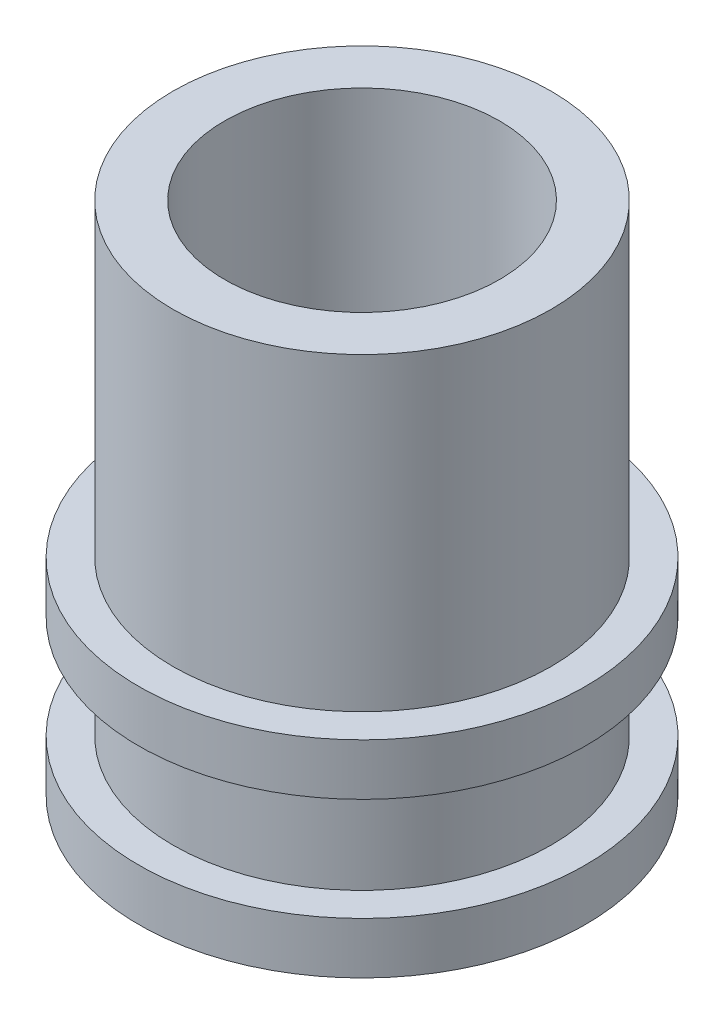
from build123d import *


with BuildPart() as part:
    # Esquisse1 → Base-R_volution (revolve)
    with BuildSketch(Plane.XY, mode=Mode.PRIVATE) as base_r_volution_sk:
        Polygon((-4, 15), (-4, 0), (-6.5, 0), (-6.5, 1.5), (-5.5, 1.5), (-5.5, 4.5), (-6.5, 4.5), (-6.5, 6), (-5.5, 6), (-5.5, 15), align=None)
    revolve(base_r_volution_sk.sketch.rotate(Axis((0, 0, 0), (0, 1, 0)), 270), axis=Axis((0, 0, 0), (0, 1, 0)))


solid = part.part
